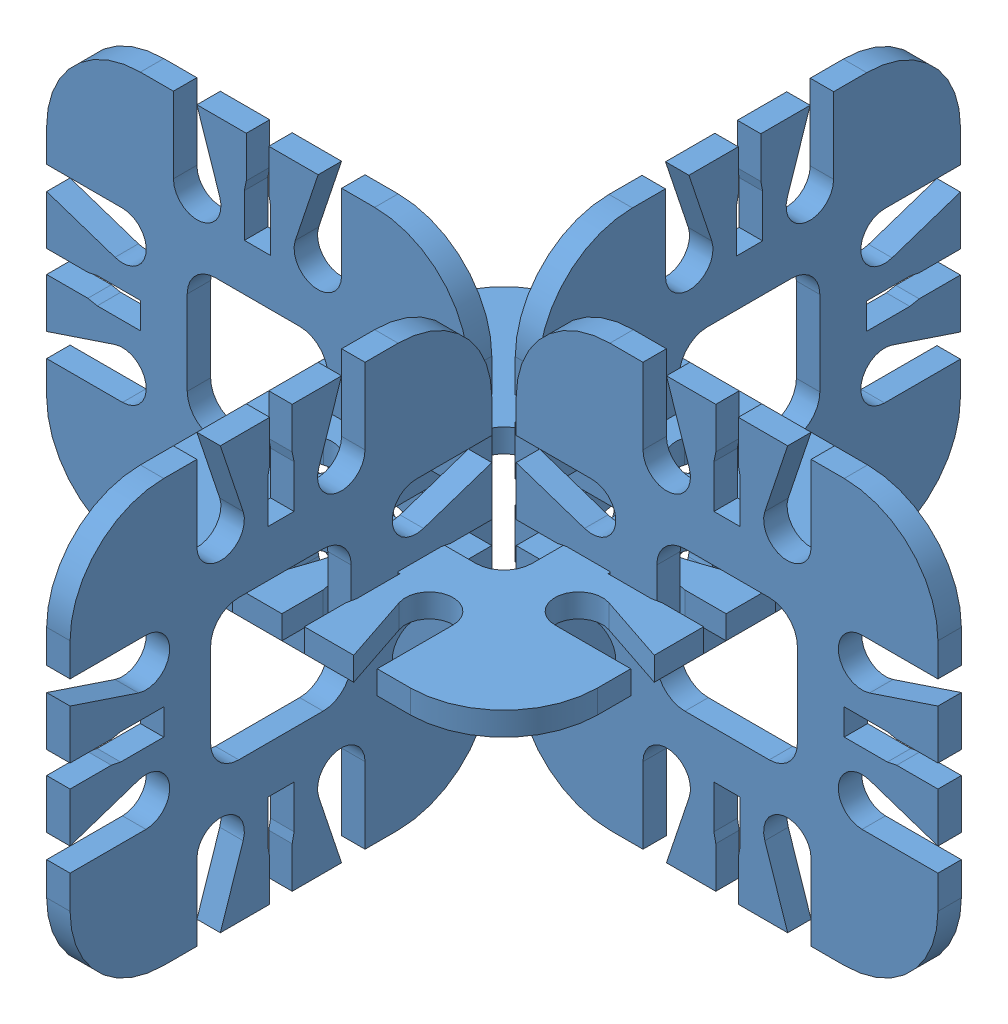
SolidWorks assembly Assem1.sldasm, configuration Default (file format 9000). Lengths in mm.
Overall size (95 45.1 95).
5 component instances, 1 part files, 15 mates.
Components (placement in the parent):
- Laser Cut Part-1: Laser Cut Part.SLDPRT [Default] at (12.3206 21.8843 37.1409) size (45 2.5 45)
- Laser Cut Part-2: Laser Cut Part.SLDPRT [Default] at (-12.6794 23.1843 35.9409) x (1 0 0) z (0 -1 0) size (45 2.5 45)
- Laser Cut Part-3: Laser Cut Part.SLDPRT [Default] at (13.5206 23.0843 62.1409) x (0 -1 0) z (0 0 -1) size (45 2.5 45)
- Laser Cut Part-4: Laser Cut Part.SLDPRT [Default] at (37.3206 23.0843 38.3409) x (1 0 0) z (0 1 0) size (45 2.5 45)
- Laser Cut Part-5: Laser Cut Part.SLDPRT [Default] at (11.0206 23.0843 12.1409) x (0 -1 0) z (0 0 1) size (45 2.5 45)
Mates (geometry in assembly coordinates):
- Coincident2: coincident anti-aligned: plane of Laser Cut Part-1 through (-0.1794 24.3843 38.5409) normal (-1 0 0); plane of Laser Cut Part-2 through (-0.1794 24.5843 38.4409) normal (1 0 0)
- Perpendicular1: perpendicular: plane of Laser Cut Part-1 through (18.7571 24.3843 51.5451) normal (0 1 0); plane of Laser Cut Part-2 through (-6.2429 8.78 38.4409) normal (0 0 1)
- Coincident5: coincident anti-aligned: plane of Laser Cut Part-1 through (18.7571 24.3843 51.5451) normal (0 1 0); plane of Laser Cut Part-2 through (9.8206 24.3843 38.4409) normal (0 -1 0)
- Perpendicular3: perpendicular: plane of Laser Cut Part-1 through (18.7571 24.3843 51.5451) normal (0 1 0); plane of Laser Cut Part-3 through (11.0206 9.014 47.7366) normal (-1 0 0)
- Coincident8: coincident: plane of Laser Cut Part-1 through (13.7206 24.3843 49.6409) normal (0 0 1); plane of Laser Cut Part-3 through (11.0206 14.0505 49.6409) normal (0 0 -1)
- Coincident9: coincident: plane of Laser Cut Part-1 through (13.5206 24.3843 59.6409) normal (-1 0 0); plane of Laser Cut Part-3 through (13.5206 9.014 47.7366) normal (1 0 0)
- Coincident10: coincident anti-aligned: plane of Laser Cut Part-1 through (18.7571 21.8843 51.5451) normal (0 -1 0); plane of Laser Cut Part-3 through (11.0206 21.8843 39.6409) normal (0 1 0)
- Perpendicular4: perpendicular: plane of Laser Cut Part-1 through (18.7571 24.3843 51.5451) normal (0 1 0); plane of Laser Cut Part-4 through (43.7571 37.4885 32.7567) normal (0 0 -1)
- Coincident12: coincident: plane of Laser Cut Part-1 through (24.8206 24.3843 35.7409) normal (1 0 0); plane of Laser Cut Part-4 through (24.8206 24.4843 35.8409) normal (-1 0 0)
- Coincident13: coincident: plane of Laser Cut Part-1 through (18.7571 21.8843 51.5451) normal (0 -1 0); plane of Laser Cut Part-4 through (19.2206 21.8843 35.8409) normal (0 1 0)
- Coincident14: coincident anti-aligned: plane of Laser Cut Part-1 through (30.4206 24.3843 38.3409) normal (0 0 -1); plane of Laser Cut Part-4 through (43.7571 37.4885 38.3409) normal (0 0 1)
- Perpendicular5: perpendicular: plane of Laser Cut Part-1 through (18.7571 24.3843 51.5451) normal (0 1 0); plane of Laser Cut Part-5 through (13.5206 16.6478 26.5451) normal (1 0 0)
- Coincident16: coincident: plane of Laser Cut Part-1 through (10.9206 24.3843 24.6409) normal (0 0 -1); plane of Laser Cut Part-5 through (13.5206 21.6843 24.6409) normal (0 0 1)
- Coincident17: coincident: plane of Laser Cut Part-1 through (13.5206 24.3843 19.0409) normal (-1 0 0); plane of Laser Cut Part-5 through (13.5206 16.6478 26.5451) normal (1 0 0)
- Coincident18: coincident anti-aligned: plane of Laser Cut Part-1 through (18.7571 21.8843 51.5451) normal (0 -1 0); plane of Laser Cut Part-5 through (13.5206 21.8843 34.6409) normal (0 1 0)
